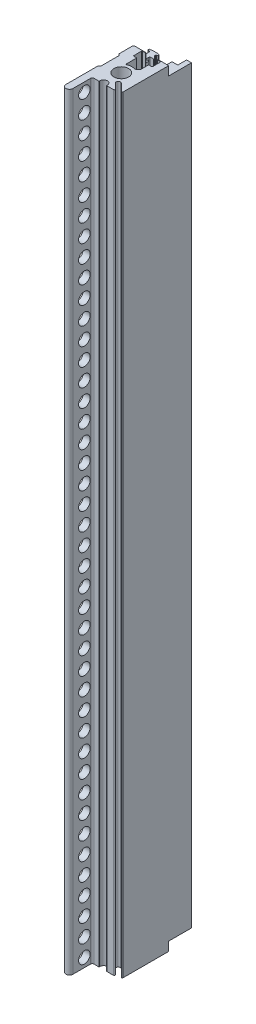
from build123d import *

# Parameters (mm, degrees)
SKETCH_1_R          = 1.6
EXTRUDE_1_DEPTH     = 109.22
SKETCH_7_W          = 5.4
SKETCH_7_H          = 2.5
SKETCH_7_H_2        = 1.2
CUT_EXTRUDE_6_DEPTH = 220.011491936
FILLET_1_R          = 0.2
SKETCH_2_R          = 2.1
CUT_EXTRUDE_1_DEPTH = 10
CUT_EXTRUDE_START   = -10
SKETCH_3_R          = 2.1
CUT_EXTRUDE_2_DEPTH = 10
SKETCH_4_R          = 1.65
CUT_EXTRUDE_3_DEPTH = 12
SKETCH_5_W          = 6.5
SKETCH_5_H          = 2.54
CUT_EXTRUDE_4_DEPTH = 10


with BuildPart() as part:
    # Sketch 1 → Extrude 1 (new, symmetric)
    with BuildSketch(Plane(origin=(0, 0, 0), x_dir=(1, 0, 0), z_dir=(0, 1, 0))):
        with BuildLine():
            Line((-4.20000049, 11.89999994), (-3.89999944, 11.899999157))
            ThreePointArc((-3.89999944, 11.899999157), (-3.758578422, 11.841420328), (-3.699999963, 11.699999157))
            Line((-3.699999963, 11.699999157), (-3.699999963, 9.94999994))
            ThreePointArc((-3.699999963, 9.94999994), (-3.758578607, 9.808578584), (-3.899999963, 9.74999994))
            Line((-3.899999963, 9.74999994), (-4.25, 9.74999994))
            ThreePointArc((-4.25, 9.74999994), (-4.391421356, 9.691421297), (-4.45, 9.54999994))
            Line((-4.45, 9.54999994), (-4.45, 8.5))
            Line((-4.45, 8.5), (-4.7, 8.5))
            Line((-4.7, 8.5), (-5, 8.2))
            Line((-5, 8.2), (-5, 7.4))
            Line((-5, 7.4), (-5, 4.4))
            Line((-5, 4.4), (-4.549867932, 3.899804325))
            Line((-4.549867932, 3.899804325), (-4.550132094, -1.100195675))
            Line((-4.550132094, -1.100195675), (-5, -1.6))
            Line((-5, -1.6), (-5, -10.75))
            ThreePointArc((-5, -10.75), (-4, -11.75), (-3, -10.75))
            Line((-3, -10.75), (-3, -5.75))
            ThreePointArc((-3, -5.75), (-2.853553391, -5.396446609), (-2.5, -5.25))
            Line((-2.5, -5.25), (-1.15000013, -5.25))
            ThreePointArc((-1.15000013, -5.25), (-1.079289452, -5.220710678), (-1.05000013, -5.15))
            Line((-1.05000013, -5.15), (-1.05000013, -5))
            ThreePointArc((-1.05000013, -5), (-1.3e-07, -3.95), (1.04999987, -5))
            Line((1.04999987, -5), (1.04999987, -5.15))
            ThreePointArc((1.04999987, -5.15), (1.079289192, -5.220710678), (1.14999987, -5.25))
            Line((1.14999987, -5.25), (3.070348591, -5.25))
            ThreePointArc((3.070348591, -5.25), (3.255124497, -5.126536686), (3.211769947, -4.908578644))
            Line((3.211769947, -4.908578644), (1.688730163, -3.385538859))
            ThreePointArc((1.688730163, -3.385538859), (1.688730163, -2.537010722), (2.5372583, -2.537010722))
            Line((2.5372583, -2.537010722), (4.658578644, -4.658331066))
            ThreePointArc((4.658578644, -4.658331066), (4.876536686, -4.701685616), (5, -4.516909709))
            Line((5, -4.516909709), (5, -2.080961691))
            Line((5, -2.080961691), (5, 5.179349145))
            Line((5, 5.179349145), (5, 15))
            Line((5, 15), (3.59999987, 15))
            Line((3.59999987, 15), (3.59999987, 12.5))
            Line((3.59999987, 12.5), (1.94999987, 12.5))
            Line((1.94999987, 12.5), (1.94999987, 10.55))
            Line((1.94999987, 10.55), (2.84999987, 10.55))
            Line((2.84999987, 10.55), (2.84999987, 9.35))
            Line((2.84999987, 9.35), (1.94999987, 9.35))
            Line((1.94999987, 9.35), (1.94999987, 8.35))
            Line((1.94999987, 8.35), (2.84999987, 8.35))
            Line((2.84999987, 8.35), (2.84999987, 6.05))
            Line((2.84999987, 6.05), (1.94999987, 6.05))
            Line((1.94999987, 6.05), (1.94999987, 3.885550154))
            ThreePointArc((1.94999987, 3.885550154), (1.567454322, 3.098943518), (0.71249987, 2.914162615))
            ThreePointArc((0.71249987, 2.914162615), (-0.242015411, 2.990222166), (-1.17187513, 2.761649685))
            ThreePointArc((-1.17187513, 2.761649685), (-1.360397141, 2.778988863), (-1.45000013, 2.945759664))
            Line((-1.45000013, 2.945759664), (-1.45000013, 6.05))
            Line((-1.45000013, 6.05), (-2.35000013, 6.05))
            Line((-2.35000013, 6.05), (-2.35000013, 8.35))
            Line((-2.35000013, 8.35), (-1.45000013, 8.35))
            Line((-1.45000013, 8.35), (-1.45000013, 9.35))
            Line((-1.45000013, 9.35), (-2.35000013, 9.35))
            Line((-2.35000013, 9.35), (-2.35000013, 10.55))
            Line((-2.35000013, 10.55), (-1.300000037, 10.55))
            Line((-1.300000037, 10.55), (-1.300000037, 10.617157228))
            ThreePointArc((-1.300000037, 10.617157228), (-1.315224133, 10.693693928), (-1.358578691, 10.758578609))
            Line((-1.358578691, 10.758578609), (-1.941421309, 11.341421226))
            ThreePointArc((-1.941421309, 11.341421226), (-1.984775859, 11.406305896), (-1.999999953, 11.482842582))
            Line((-1.999999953, 11.482842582), (-1.999999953, 11.699999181))
            ThreePointArc((-1.999999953, 11.699999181), (-1.941421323, 11.841420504), (-1.8, 11.899999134))
            Line((-1.8, 11.899999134), (-1.7, 11.899999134))
            ThreePointArc((-1.7, 11.899999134), (-1.558578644, 11.958577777), (-1.5, 12.099999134))
            Line((-1.5, 12.099999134), (-1.5, 12.199999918))
            ThreePointArc((-1.5, 12.199999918), (-1.558578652, 12.341421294), (-1.700000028, 12.399999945))
            Line((-1.700000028, 12.399999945), (-1.867157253, 12.399999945))
            ThreePointArc((-1.867157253, 12.399999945), (-1.943693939, 12.415224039), (-2.008578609, 12.458578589))
            Line((-2.008578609, 12.458578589), (-2.050000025, 12.500000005))
            Line((-2.050000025, 12.500000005), (-3.849999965, 12.500000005))
            Line((-3.849999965, 12.500000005), (-3.891421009, 12.458578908))
            ThreePointArc((-3.891421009, 12.458578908), (-3.95630571, 12.415224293), (-4.032842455, 12.400000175))
            Line((-4.032842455, 12.400000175), (-4.199999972, 12.400000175))
            ThreePointArc((-4.199999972, 12.400000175), (-4.341421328, 12.341421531), (-4.399999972, 12.200000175))
            Line((-4.399999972, 12.200000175), (-4.399999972, 12.099999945))
            ThreePointArc((-4.399999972, 12.099999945), (-4.341421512, 11.95857877), (-4.20000049, 11.89999994))
        make_face()
        with Locations(Location((-1.3e-07, 0, 0), (0, 0, 270))):
            Circle(SKETCH_1_R, mode=Mode.SUBTRACT)
    extrude(amount=EXTRUDE_1_DEPTH, both=True)

    # Sketch 7 → Cut-Extrude 6 (cut, through all)
    with BuildSketch(Plane(origin=(0, 109.22, 0), x_dir=(1, 0, 0), z_dir=(0, 1, 0))):
        with Locations((0.24999987, 7.1)):
            Rectangle(SKETCH_7_W, SKETCH_7_H)
        with Locations((0.24999987, 9.95)):
            Rectangle(SKETCH_7_W, SKETCH_7_H_2)
    extrude(amount=-CUT_EXTRUDE_6_DEPTH, mode=Mode.SUBTRACT)

    # Fillet 1
    fillet_1_edges = [part.edges().sort_by_distance(p)[0] for p in [
        (2.94999987, 0, -5.85),
        (-2.45000013, 0, -8.35),
        (2.94999987, 0, -8.35),
        (-2.45000013, 0, -5.85),
        (2.94999987, 0, -9.35),
        (-2.45000013, 0, -10.55),
        (2.94999987, 0, -10.55),
        (-2.45000013, 0, -9.35),
    ]]
    fillet(fillet_1_edges, radius=FILLET_1_R)

    # Sketch 2 → Cut-Extrude 1 (cut)
    with BuildSketch(Plane(origin=(0, 109.22, 0), x_dir=(1, 0, 0), z_dir=(0, 1, 0))):
        with Locations(Location((0, 0, 0), (0, 0, 270))):
            Circle(SKETCH_2_R)
    extrude(amount=-CUT_EXTRUDE_1_DEPTH, mode=Mode.SUBTRACT)

    # Sketch 3 → Cut-Extrude 2 (cut)
    with BuildSketch(Plane.XZ.offset(109.22).offset(CUT_EXTRUDE_START)):
        with Locations(Location((0, 0, 0), (0, 0, 90))):
            Circle(SKETCH_3_R)
    extrude(amount=CUT_EXTRUDE_2_DEPTH, mode=Mode.SUBTRACT)

    # Sketch 4 → Cut-Extrude 3 (cut)
    with BuildSketch(Plane.ZY.offset(5)):
        with Locations((7.5, -106.68)):
            Circle(SKETCH_4_R)
        with Locations((7.5, -101.6)):
            Circle(SKETCH_4_R)
        with Locations((7.5, -96.52)):
            Circle(SKETCH_4_R)
        with Locations((7.5, -91.44)):
            Circle(SKETCH_4_R)
        with Locations((7.5, -86.36)):
            Circle(SKETCH_4_R)
        with Locations((7.5, -81.28)):
            Circle(SKETCH_4_R)
        with Locations((7.5, -76.2)):
            Circle(SKETCH_4_R)
        with Locations((7.5, -71.12)):
            Circle(SKETCH_4_R)
        with Locations((7.5, -66.04)):
            Circle(SKETCH_4_R)
        with Locations((7.5, -60.96)):
            Circle(SKETCH_4_R)
        with Locations((7.5, -55.88)):
            Circle(SKETCH_4_R)
        with Locations((7.5, -50.8)):
            Circle(SKETCH_4_R)
        with Locations((7.5, -45.72)):
            Circle(SKETCH_4_R)
        with Locations((7.5, -40.64)):
            Circle(SKETCH_4_R)
        with Locations((7.5, -35.56)):
            Circle(SKETCH_4_R)
        with Locations((7.5, -30.48)):
            Circle(SKETCH_4_R)
        with Locations((7.5, -25.4)):
            Circle(SKETCH_4_R)
        with Locations((7.5, -20.32)):
            Circle(SKETCH_4_R)
        with Locations((7.5, -15.24)):
            Circle(SKETCH_4_R)
        with Locations((7.5, -10.16)):
            Circle(SKETCH_4_R)
        with Locations((7.5, -5.08)):
            Circle(SKETCH_4_R)
        with Locations((7.5, 0)):
            Circle(SKETCH_4_R)
        with Locations((7.5, 5.08)):
            Circle(SKETCH_4_R)
        with Locations((7.5, 10.16)):
            Circle(SKETCH_4_R)
        with Locations((7.5, 15.24)):
            Circle(SKETCH_4_R)
        with Locations((7.5, 20.32)):
            Circle(SKETCH_4_R)
        with Locations((7.5, 25.4)):
            Circle(SKETCH_4_R)
        with Locations((7.5, 30.48)):
            Circle(SKETCH_4_R)
        with Locations((7.5, 35.56)):
            Circle(SKETCH_4_R)
        with Locations((7.5, 40.64)):
            Circle(SKETCH_4_R)
        with Locations((7.5, 45.72)):
            Circle(SKETCH_4_R)
        with Locations((7.5, 50.8)):
            Circle(SKETCH_4_R)
        with Locations((7.5, 55.88)):
            Circle(SKETCH_4_R)
        with Locations((7.5, 60.96)):
            Circle(SKETCH_4_R)
        with Locations((7.5, 66.04)):
            Circle(SKETCH_4_R)
        with Locations((7.5, 71.12)):
            Circle(SKETCH_4_R)
        with Locations((7.5, 76.2)):
            Circle(SKETCH_4_R)
        with Locations((7.5, 81.28)):
            Circle(SKETCH_4_R)
        with Locations((7.5, 86.36)):
            Circle(SKETCH_4_R)
        with Locations((7.5, 91.44)):
            Circle(SKETCH_4_R)
        with Locations((7.5, 96.52)):
            Circle(SKETCH_4_R)
        with Locations((7.5, 101.6)):
            Circle(SKETCH_4_R)
        with Locations((7.5, 106.68)):
            Circle(SKETCH_4_R)
        with Locations((7.5, 111.76)):
            Circle(SKETCH_4_R)
        with Locations((7.5, 116.84)):
            Circle(SKETCH_4_R)
        with Locations((7.5, 121.92)):
            Circle(SKETCH_4_R)
        with Locations((7.5, 127)):
            Circle(SKETCH_4_R)
        with Locations((7.5, 132.08)):
            Circle(SKETCH_4_R)
        with Locations((7.5, 137.16)):
            Circle(SKETCH_4_R)
        with Locations((7.5, 142.24)):
            Circle(SKETCH_4_R)
        with Locations((7.5, 147.32)):
            Circle(SKETCH_4_R)
        with Locations((7.5, 152.4)):
            Circle(SKETCH_4_R)
        with Locations((7.5, 157.48)):
            Circle(SKETCH_4_R)
        with Locations((7.5, 162.56)):
            Circle(SKETCH_4_R)
        with Locations((7.5, 167.64)):
            Circle(SKETCH_4_R)
        with Locations((7.5, 172.72)):
            Circle(SKETCH_4_R)
        with Locations((7.5, 177.8)):
            Circle(SKETCH_4_R)
        with Locations((7.5, 182.88)):
            Circle(SKETCH_4_R)
        with Locations((7.5, 187.96)):
            Circle(SKETCH_4_R)
        with Locations((7.5, 193.04)):
            Circle(SKETCH_4_R)
        with Locations((7.5, 198.12)):
            Circle(SKETCH_4_R)
        with Locations((7.5, 203.2)):
            Circle(SKETCH_4_R)
        with Locations((7.5, 208.28)):
            Circle(SKETCH_4_R)
        with Locations((7.5, 213.36)):
            Circle(SKETCH_4_R)
        with Locations((7.5, 218.44)):
            Circle(SKETCH_4_R)
        with Locations((7.5, 223.52)):
            Circle(SKETCH_4_R)
        with Locations((7.5, 228.6)):
            Circle(SKETCH_4_R)
        with Locations((7.5, 233.68)):
            Circle(SKETCH_4_R)
        with Locations((7.5, 238.76)):
            Circle(SKETCH_4_R)
        with Locations((7.5, 243.84)):
            Circle(SKETCH_4_R)
        with Locations((7.5, 248.92)):
            Circle(SKETCH_4_R)
        with Locations((7.5, 254)):
            Circle(SKETCH_4_R)
        with Locations((7.5, 259.08)):
            Circle(SKETCH_4_R)
        with Locations((7.5, 264.16)):
            Circle(SKETCH_4_R)
        with Locations((7.5, 269.24)):
            Circle(SKETCH_4_R)
        with Locations((7.5, 274.32)):
            Circle(SKETCH_4_R)
        with Locations((7.5, 279.4)):
            Circle(SKETCH_4_R)
        with Locations((7.5, 284.48)):
            Circle(SKETCH_4_R)
        with Locations((7.5, 289.56)):
            Circle(SKETCH_4_R)
        with Locations((7.5, 294.64)):
            Circle(SKETCH_4_R)
        with Locations((7.5, 299.72)):
            Circle(SKETCH_4_R)
        with Locations((7.5, 304.8)):
            Circle(SKETCH_4_R)
        with Locations((7.5, 309.88)):
            Circle(SKETCH_4_R)
        with Locations((7.5, 314.96)):
            Circle(SKETCH_4_R)
        with Locations((7.5, 320.04)):
            Circle(SKETCH_4_R)
    extrude(amount=-CUT_EXTRUDE_3_DEPTH, mode=Mode.SUBTRACT)

    # Sketch 5 → Cut-Extrude 4 (cut)
    with BuildSketch(Plane(origin=(5, 0, 0), x_dir=(0, 0, -1), z_dir=(1, 0, 0))):
        with Locations((11.75, 107.95)):
            Rectangle(SKETCH_5_W, SKETCH_5_H)
        with Locations((11.75, -107.95)):
            Rectangle(SKETCH_5_W, SKETCH_5_H)
    extrude(amount=-CUT_EXTRUDE_4_DEPTH, mode=Mode.SUBTRACT)


solid = part.part
